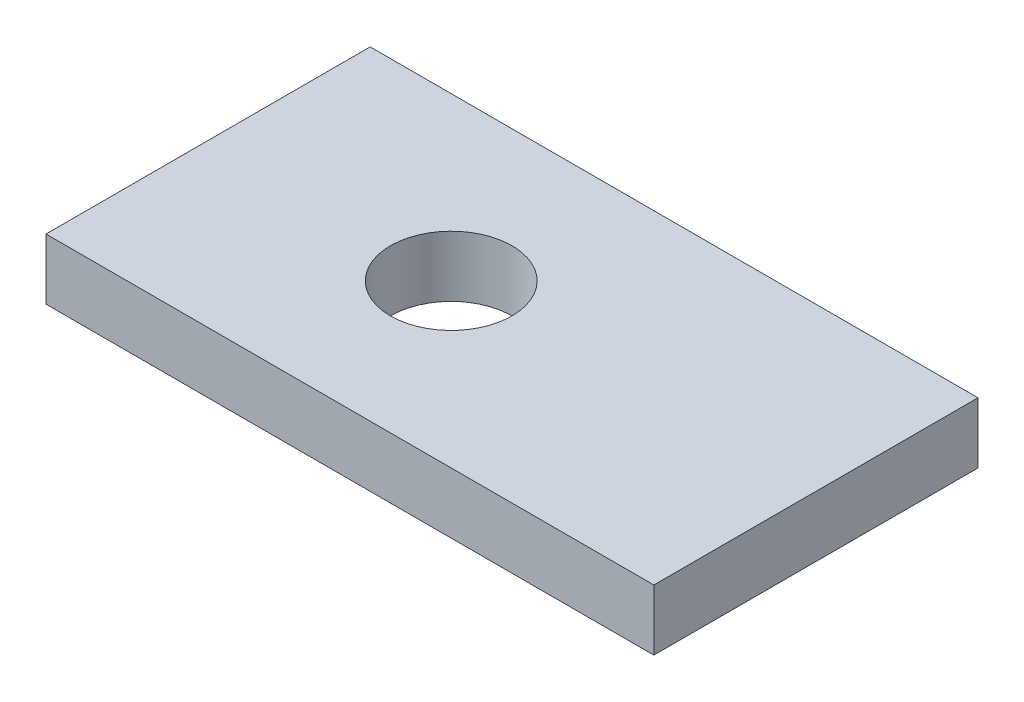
ISO-10303-21;
HEADER;
FILE_DESCRIPTION(('STEP AP214'),'2;1');
FILE_NAME('part.step','',(''),(''),'','','');
FILE_SCHEMA(('AUTOMOTIVE_DESIGN { 1 0 10303 214 1 1 1 1 }'));
ENDSEC;
DATA;
#1=APPLICATION_CONTEXT('core data for automotive mechanical design processes');
#2=APPLICATION_PROTOCOL_DEFINITION('international standard','automotive_design',2000,#1);
#3=PRODUCT_CONTEXT('',#1,'mechanical');
#4=PRODUCT('Part','Part','',(#3));
#5=PRODUCT_RELATED_PRODUCT_CATEGORY('part','',(#4));
#6=PRODUCT_DEFINITION_FORMATION('','',#4);
#7=PRODUCT_DEFINITION_CONTEXT('part definition',#1,'design');
#8=PRODUCT_DEFINITION('design','',#6,#7);
#9=PRODUCT_DEFINITION_SHAPE('','',#8);
#10=(LENGTH_UNIT() NAMED_UNIT(*) SI_UNIT(.MILLI.,.METRE.));
#11=(NAMED_UNIT(*) PLANE_ANGLE_UNIT() SI_UNIT($,.RADIAN.));
#12=(NAMED_UNIT(*) SI_UNIT($,.STERADIAN.) SOLID_ANGLE_UNIT());
#13=UNCERTAINTY_MEASURE_WITH_UNIT(LENGTH_MEASURE(1.E-05),#10,'distance_accuracy_value','');
#14=(GEOMETRIC_REPRESENTATION_CONTEXT(3) GLOBAL_UNCERTAINTY_ASSIGNED_CONTEXT((#13)) GLOBAL_UNIT_ASSIGNED_CONTEXT((#10,
#11,#12)) REPRESENTATION_CONTEXT('',''));
#15=CARTESIAN_POINT('',(0.,0.,0.));
#16=DIRECTION('',(0.,0.,1.));
#17=DIRECTION('',(1.,0.,0.));
#18=AXIS2_PLACEMENT_3D('',#15,#16,#17);
#19=CARTESIAN_POINT('',(0.,-15.,0.));
#20=DIRECTION('',(-1.,0.,0.));
#21=DIRECTION('',(0.,0.,1.));
#22=AXIS2_PLACEMENT_3D('',#19,#20,#21);
#23=PLANE('',#22);
#24=DIRECTION('',(0.,0.,1.));
#25=VECTOR('',#24,1.);
#26=CARTESIAN_POINT('',(0.,0.,0.));
#27=LINE('',#26,#25);
#28=CARTESIAN_POINT('',(0.,0.,-80.));
#29=VERTEX_POINT('',#28);
#30=CARTESIAN_POINT('',(0.,0.,0.));
#31=VERTEX_POINT('',#30);
#32=EDGE_CURVE('E106',#29,#31,#27,.T.);
#33=ORIENTED_EDGE('',*,*,#32,.F.);
#34=DIRECTION('',(0.,1.,0.));
#35=VECTOR('',#34,1.);
#36=CARTESIAN_POINT('',(0.,-15.,-80.));
#37=LINE('',#36,#35);
#38=CARTESIAN_POINT('',(0.,-15.,-80.));
#39=VERTEX_POINT('',#38);
#40=EDGE_CURVE('E11',#39,#29,#37,.T.);
#41=ORIENTED_EDGE('',*,*,#40,.F.);
#42=DIRECTION('',(0.,0.,1.));
#43=VECTOR('',#42,1.);
#44=CARTESIAN_POINT('',(0.,-15.,0.));
#45=LINE('',#44,#43);
#46=CARTESIAN_POINT('',(0.,-15.,0.));
#47=VERTEX_POINT('',#46);
#48=EDGE_CURVE('E97',#39,#47,#45,.T.);
#49=ORIENTED_EDGE('',*,*,#48,.T.);
#50=DIRECTION('',(0.,1.,0.));
#51=VECTOR('',#50,1.);
#52=CARTESIAN_POINT('',(0.,-15.,0.));
#53=LINE('',#52,#51);
#54=EDGE_CURVE('E42',#47,#31,#53,.T.);
#55=ORIENTED_EDGE('',*,*,#54,.T.);
#56=EDGE_LOOP('',(#33,#41,#49,#55));
#57=FACE_BOUND('',#56,.T.);
#58=ADVANCED_FACE('F41',(#57),#23,.T.);
#59=CARTESIAN_POINT('',(0.,-15.,-80.));
#60=DIRECTION('',(0.,0.,-1.));
#61=DIRECTION('',(-1.,0.,0.));
#62=AXIS2_PLACEMENT_3D('',#59,#60,#61);
#63=PLANE('',#62);
#64=DIRECTION('',(-1.,0.,0.));
#65=VECTOR('',#64,1.);
#66=CARTESIAN_POINT('',(0.,0.,-80.));
#67=LINE('',#66,#65);
#68=CARTESIAN_POINT('',(150.,0.,-80.));
#69=VERTEX_POINT('',#68);
#70=EDGE_CURVE('E101',#69,#29,#67,.T.);
#71=ORIENTED_EDGE('',*,*,#70,.F.);
#72=DIRECTION('',(0.,1.,0.));
#73=VECTOR('',#72,1.);
#74=CARTESIAN_POINT('',(150.,-15.,-80.));
#75=LINE('',#74,#73);
#76=CARTESIAN_POINT('',(150.,-15.,-80.));
#77=VERTEX_POINT('',#76);
#78=EDGE_CURVE('E49',#77,#69,#75,.T.);
#79=ORIENTED_EDGE('',*,*,#78,.F.);
#80=DIRECTION('',(-1.,0.,0.));
#81=VECTOR('',#80,1.);
#82=CARTESIAN_POINT('',(0.,-15.,-80.));
#83=LINE('',#82,#81);
#84=EDGE_CURVE('E96',#77,#39,#83,.T.);
#85=ORIENTED_EDGE('',*,*,#84,.T.);
#86=ORIENTED_EDGE('',*,*,#40,.T.);
#87=EDGE_LOOP('',(#71,#79,#85,#86));
#88=FACE_BOUND('',#87,.T.);
#89=ADVANCED_FACE('F119',(#88),#63,.T.);
#90=CARTESIAN_POINT('',(150.,-15.,0.));
#91=DIRECTION('',(1.,0.,0.));
#92=DIRECTION('',(0.,0.,-1.));
#93=AXIS2_PLACEMENT_3D('',#90,#91,#92);
#94=PLANE('',#93);
#95=DIRECTION('',(0.,0.,-1.));
#96=VECTOR('',#95,1.);
#97=CARTESIAN_POINT('',(150.,0.,0.));
#98=LINE('',#97,#96);
#99=CARTESIAN_POINT('',(150.,0.,0.));
#100=VERTEX_POINT('',#99);
#101=EDGE_CURVE('E93',#100,#69,#98,.T.);
#102=ORIENTED_EDGE('',*,*,#101,.F.);
#103=DIRECTION('',(0.,1.,0.));
#104=VECTOR('',#103,1.);
#105=CARTESIAN_POINT('',(150.,-15.,0.));
#106=LINE('',#105,#104);
#107=CARTESIAN_POINT('',(150.,-15.,0.));
#108=VERTEX_POINT('',#107);
#109=EDGE_CURVE('E88',#108,#100,#106,.T.);
#110=ORIENTED_EDGE('',*,*,#109,.F.);
#111=DIRECTION('',(0.,0.,-1.));
#112=VECTOR('',#111,1.);
#113=CARTESIAN_POINT('',(150.,-15.,0.));
#114=LINE('',#113,#112);
#115=EDGE_CURVE('E90',#108,#77,#114,.T.);
#116=ORIENTED_EDGE('',*,*,#115,.T.);
#117=ORIENTED_EDGE('',*,*,#78,.T.);
#118=EDGE_LOOP('',(#102,#110,#116,#117));
#119=FACE_BOUND('',#118,.T.);
#120=ADVANCED_FACE('F86',(#119),#94,.T.);
#121=CARTESIAN_POINT('',(0.,-15.,0.));
#122=DIRECTION('',(0.,0.,1.));
#123=DIRECTION('',(1.,0.,0.));
#124=AXIS2_PLACEMENT_3D('',#121,#122,#123);
#125=PLANE('',#124);
#126=DIRECTION('',(1.,0.,0.));
#127=VECTOR('',#126,1.);
#128=CARTESIAN_POINT('',(0.,0.,0.));
#129=LINE('',#128,#127);
#130=EDGE_CURVE('E108',#31,#100,#129,.T.);
#131=ORIENTED_EDGE('',*,*,#130,.F.);
#132=ORIENTED_EDGE('',*,*,#54,.F.);
#133=DIRECTION('',(1.,0.,0.));
#134=VECTOR('',#133,1.);
#135=CARTESIAN_POINT('',(0.,-15.,0.));
#136=LINE('',#135,#134);
#137=EDGE_CURVE('E92',#47,#108,#136,.T.);
#138=ORIENTED_EDGE('',*,*,#137,.T.);
#139=ORIENTED_EDGE('',*,*,#109,.T.);
#140=EDGE_LOOP('',(#131,#132,#138,#139));
#141=FACE_BOUND('',#140,.T.);
#142=ADVANCED_FACE('F98',(#141),#125,.T.);
#143=CARTESIAN_POINT('',(0.,-15.,0.));
#144=DIRECTION('',(0.,-1.,0.));
#145=DIRECTION('',(0.,0.,-1.));
#146=AXIS2_PLACEMENT_3D('',#143,#144,#145);
#147=PLANE('',#146);
#148=CARTESIAN_POINT('',(60.,-15.,-40.));
#149=DIRECTION('',(0.,1.,0.));
#150=DIRECTION('',(0.,0.,1.));
#151=AXIS2_PLACEMENT_3D('',#148,#149,#150);
#152=CIRCLE('',#151,15.);
#153=CARTESIAN_POINT('',(60.,-15.,-25.));
#154=VERTEX_POINT('',#153);
#155=EDGE_CURVE('E109',#154,#154,#152,.T.);
#156=ORIENTED_EDGE('',*,*,#155,.T.);
#157=EDGE_LOOP('',(#156));
#158=FACE_BOUND('',#157,.T.);
#159=ORIENTED_EDGE('',*,*,#48,.F.);
#160=ORIENTED_EDGE('',*,*,#84,.F.);
#161=ORIENTED_EDGE('',*,*,#115,.F.);
#162=ORIENTED_EDGE('',*,*,#137,.F.);
#163=EDGE_LOOP('',(#159,#160,#161,#162));
#164=FACE_BOUND('',#163,.T.);
#165=ADVANCED_FACE('F94',(#158,#164),#147,.T.);
#166=CARTESIAN_POINT('',(0.,0.,0.));
#167=DIRECTION('',(0.,-1.,0.));
#168=DIRECTION('',(0.,0.,-1.));
#169=AXIS2_PLACEMENT_3D('',#166,#167,#168);
#170=PLANE('',#169);
#171=CARTESIAN_POINT('',(60.,0.,-40.));
#172=DIRECTION('',(0.,1.,0.));
#173=DIRECTION('',(0.,0.,1.));
#174=AXIS2_PLACEMENT_3D('',#171,#172,#173);
#175=CIRCLE('',#174,15.);
#176=CARTESIAN_POINT('',(60.,0.,-25.));
#177=VERTEX_POINT('',#176);
#178=EDGE_CURVE('E150',#177,#177,#175,.T.);
#179=ORIENTED_EDGE('',*,*,#178,.F.);
#180=EDGE_LOOP('',(#179));
#181=FACE_BOUND('',#180,.T.);
#182=ORIENTED_EDGE('',*,*,#32,.T.);
#183=ORIENTED_EDGE('',*,*,#130,.T.);
#184=ORIENTED_EDGE('',*,*,#101,.T.);
#185=ORIENTED_EDGE('',*,*,#70,.T.);
#186=EDGE_LOOP('',(#182,#183,#184,#185));
#187=FACE_BOUND('',#186,.T.);
#188=ADVANCED_FACE('F118',(#181,#187),#170,.F.);
#189=CARTESIAN_POINT('',(60.,-15.,-40.));
#190=DIRECTION('',(0.,1.,0.));
#191=DIRECTION('',(0.,0.,1.));
#192=AXIS2_PLACEMENT_3D('',#189,#190,#191);
#193=CYLINDRICAL_SURFACE('',#192,15.);
#194=ORIENTED_EDGE('',*,*,#155,.F.);
#195=EDGE_LOOP('',(#194));
#196=FACE_BOUND('',#195,.T.);
#197=ORIENTED_EDGE('',*,*,#178,.T.);
#198=EDGE_LOOP('',(#197));
#199=FACE_BOUND('',#198,.T.);
#200=ADVANCED_FACE('F131',(#196,#199),#193,.F.);
#201=CLOSED_SHELL('',(#58,#89,#120,#142,#165,#188,#200));
#202=MANIFOLD_SOLID_BREP('B2',#201);
#203=ADVANCED_BREP_SHAPE_REPRESENTATION('',(#18,#202),#14);
#204=SHAPE_DEFINITION_REPRESENTATION(#9,#203);
ENDSEC;
END-ISO-10303-21;
